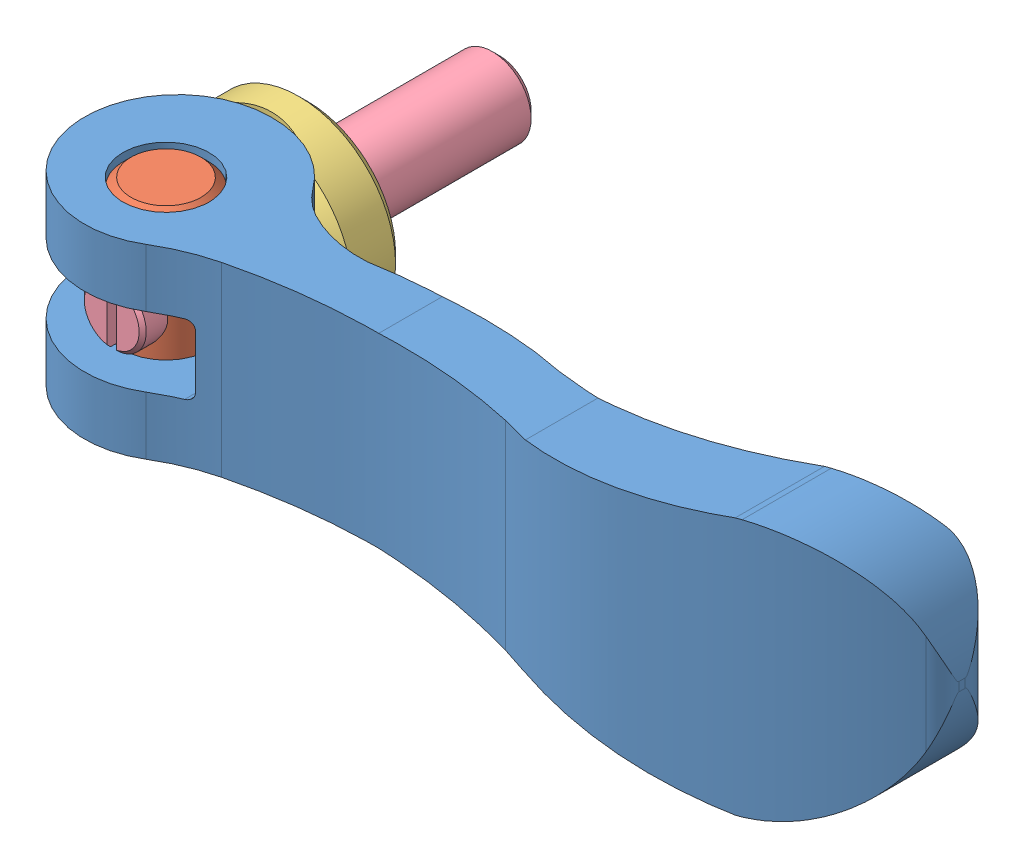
SolidWorks assembly KCL10X25-SUS.SLDASM, configuration Default (file format 15000). Lengths in mm.
Overall size (108.51 33.22 53.5).
4 component instances, 4 part files, 0 mates.
Components (placement in the parent):
- KCL10X25-SUS_01-1: KCL10X25-SUS_01.SLDPRT [ﾃﾞﾌｫﾙﾄ] at (0 0 18.3) x (1 0 0) z (0 -1 0) size (108.01 24 33.22)
- KCL10X25-SUS_02-1: KCL10X25-SUS_02.SLDPRT [ﾃﾞﾌｫﾙﾄ] at (0 0 18.3) x (0 1 0) z (1 0 0) size (24 11 11)
- KCL10X25-SUS_03-1: KCL10X25-SUS_03.SLDPRT [ﾃﾞﾌｫﾙﾄ] x (1 0 0) z (0 -1 0) size (25 8 25)
- KCL10X25-SUS_04-1: KCL10X25-SUS_04.SLDPRT [ﾃﾞﾌｫﾙﾄ] at (0 0 -24.7) x (0 1 0) z (1 0 0) size (10 50 10)
